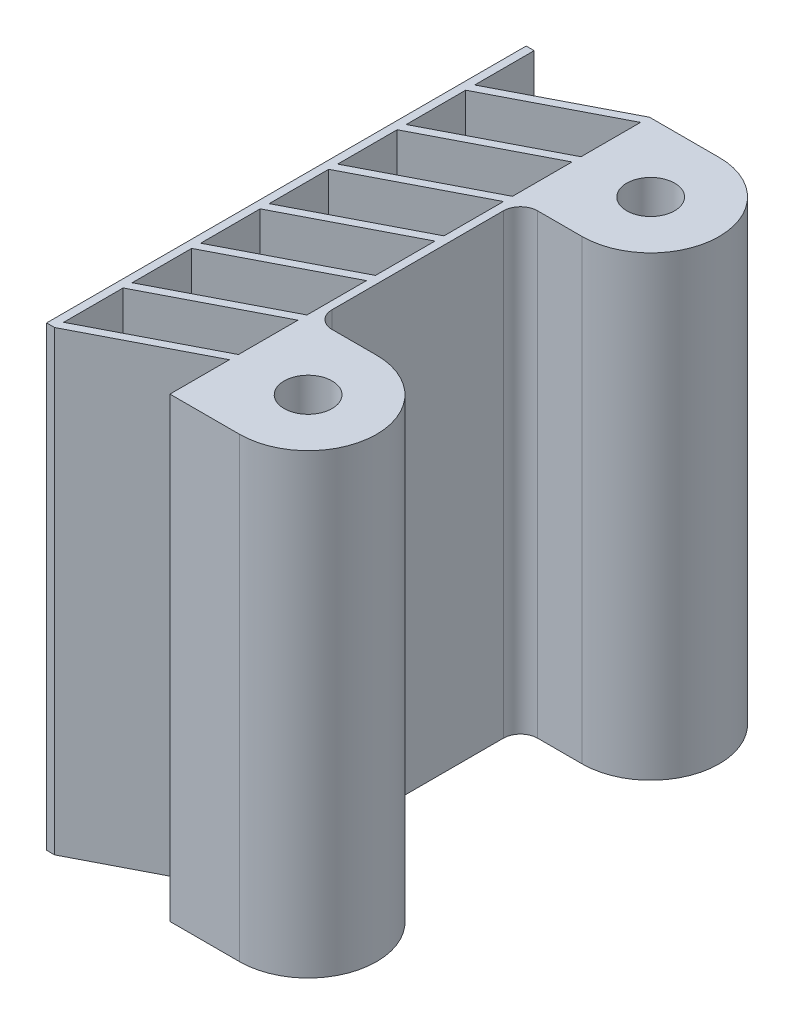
ISO-10303-21;
HEADER;
FILE_DESCRIPTION(('STEP AP214'),'2;1');
FILE_NAME('part.step','',(''),(''),'','','');
FILE_SCHEMA(('AUTOMOTIVE_DESIGN { 1 0 10303 214 1 1 1 1 }'));
ENDSEC;
DATA;
#1=APPLICATION_CONTEXT('core data for automotive mechanical design processes');
#2=APPLICATION_PROTOCOL_DEFINITION('international standard','automotive_design',2000,#1);
#3=PRODUCT_CONTEXT('',#1,'mechanical');
#4=PRODUCT('Part','Part','',(#3));
#5=PRODUCT_RELATED_PRODUCT_CATEGORY('part','',(#4));
#6=PRODUCT_DEFINITION_FORMATION('','',#4);
#7=PRODUCT_DEFINITION_CONTEXT('part definition',#1,'design');
#8=PRODUCT_DEFINITION('design','',#6,#7);
#9=PRODUCT_DEFINITION_SHAPE('','',#8);
#10=(LENGTH_UNIT() NAMED_UNIT(*) SI_UNIT(.MILLI.,.METRE.));
#11=(NAMED_UNIT(*) PLANE_ANGLE_UNIT() SI_UNIT($,.RADIAN.));
#12=(NAMED_UNIT(*) SI_UNIT($,.STERADIAN.) SOLID_ANGLE_UNIT());
#13=UNCERTAINTY_MEASURE_WITH_UNIT(LENGTH_MEASURE(1.E-05),#10,'distance_accuracy_value','');
#14=(GEOMETRIC_REPRESENTATION_CONTEXT(3) GLOBAL_UNCERTAINTY_ASSIGNED_CONTEXT((#13)) GLOBAL_UNIT_ASSIGNED_CONTEXT((#10,
#11,#12)) REPRESENTATION_CONTEXT('',''));
#15=CARTESIAN_POINT('',(0.,0.,0.));
#16=DIRECTION('',(0.,0.,1.));
#17=DIRECTION('',(1.,0.,0.));
#18=AXIS2_PLACEMENT_3D('',#15,#16,#17);
#19=CARTESIAN_POINT('',(-237.,40.,199.));
#20=DIRECTION('',(0.,0.,1.));
#21=DIRECTION('',(1.,0.,0.));
#22=AXIS2_PLACEMENT_3D('',#19,#20,#21);
#23=PLANE('',#22);
#24=DIRECTION('',(-1.,0.,0.));
#25=VECTOR('',#24,1.);
#26=CARTESIAN_POINT('',(-237.,40.,199.));
#27=LINE('',#26,#25);
#28=CARTESIAN_POINT('',(-253.2,40.,199.));
#29=VERTEX_POINT('',#28);
#30=CARTESIAN_POINT('',(-253.9,40.,199.));
#31=VERTEX_POINT('',#30);
#32=EDGE_CURVE('E412',#29,#31,#27,.T.);
#33=ORIENTED_EDGE('',*,*,#32,.F.);
#34=DIRECTION('',(0.,1.,0.));
#35=VECTOR('',#34,1.);
#36=CARTESIAN_POINT('',(-253.2,0.,199.));
#37=LINE('',#36,#35);
#38=CARTESIAN_POINT('',(-253.2,0.,199.));
#39=VERTEX_POINT('',#38);
#40=EDGE_CURVE('E634',#39,#29,#37,.T.);
#41=ORIENTED_EDGE('',*,*,#40,.F.);
#42=DIRECTION('',(-1.,0.,0.));
#43=VECTOR('',#42,1.);
#44=CARTESIAN_POINT('',(-237.,0.,199.));
#45=LINE('',#44,#43);
#46=CARTESIAN_POINT('',(-253.9,0.,199.));
#47=VERTEX_POINT('',#46);
#48=EDGE_CURVE('E347',#39,#47,#45,.T.);
#49=ORIENTED_EDGE('',*,*,#48,.T.);
#50=DIRECTION('',(0.,-1.,0.));
#51=VECTOR('',#50,1.);
#52=CARTESIAN_POINT('',(-253.9,40.,199.));
#53=LINE('',#52,#51);
#54=EDGE_CURVE('E357',#31,#47,#53,.T.);
#55=ORIENTED_EDGE('',*,*,#54,.F.);
#56=EDGE_LOOP('',(#33,#41,#49,#55));
#57=FACE_BOUND('',#56,.T.);
#58=ADVANCED_FACE('F41',(#57),#23,.F.);
#59=CARTESIAN_POINT('',(-253.9,40.,241.));
#60=DIRECTION('',(0.,0.,-1.));
#61=DIRECTION('',(-1.,0.,0.));
#62=AXIS2_PLACEMENT_3D('',#59,#60,#61);
#63=PLANE('',#62);
#64=DIRECTION('',(1.,0.,0.));
#65=VECTOR('',#64,1.);
#66=CARTESIAN_POINT('',(-253.9,0.,241.));
#67=LINE('',#66,#65);
#68=CARTESIAN_POINT('',(-253.9,0.,241.));
#69=VERTEX_POINT('',#68);
#70=CARTESIAN_POINT('',(-253.199999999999,0.,241.));
#71=VERTEX_POINT('',#70);
#72=EDGE_CURVE('E317',#69,#71,#67,.T.);
#73=ORIENTED_EDGE('',*,*,#72,.T.);
#74=DIRECTION('',(0.,1.,0.));
#75=VECTOR('',#74,1.);
#76=CARTESIAN_POINT('',(-253.199999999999,0.,241.));
#77=LINE('',#76,#75);
#78=CARTESIAN_POINT('',(-253.199999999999,40.,241.));
#79=VERTEX_POINT('',#78);
#80=EDGE_CURVE('E300',#71,#79,#77,.T.);
#81=ORIENTED_EDGE('',*,*,#80,.T.);
#82=DIRECTION('',(1.,0.,0.));
#83=VECTOR('',#82,1.);
#84=CARTESIAN_POINT('',(-253.9,40.,241.));
#85=LINE('',#84,#83);
#86=CARTESIAN_POINT('',(-253.9,40.,241.));
#87=VERTEX_POINT('',#86);
#88=EDGE_CURVE('E315',#87,#79,#85,.T.);
#89=ORIENTED_EDGE('',*,*,#88,.F.);
#90=DIRECTION('',(0.,-1.,0.));
#91=VECTOR('',#90,1.);
#92=CARTESIAN_POINT('',(-253.9,40.,241.));
#93=LINE('',#92,#91);
#94=EDGE_CURVE('E328',#87,#69,#93,.T.);
#95=ORIENTED_EDGE('',*,*,#94,.T.);
#96=EDGE_LOOP('',(#73,#81,#89,#95));
#97=FACE_BOUND('',#96,.T.);
#98=ADVANCED_FACE('F313',(#97),#63,.F.);
#99=CARTESIAN_POINT('',(-237.,40.,235.));
#100=DIRECTION('',(0.,1.,0.));
#101=DIRECTION('',(0.,0.,1.));
#102=AXIS2_PLACEMENT_3D('',#99,#100,#101);
#103=PLANE('',#102);
#104=DIRECTION('',(0.,0.,1.));
#105=VECTOR('',#104,1.);
#106=CARTESIAN_POINT('',(-253.199999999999,40.,240.212282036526));
#107=LINE('',#106,#105);
#108=CARTESIAN_POINT('',(-253.2,40.,235.));
#109=VERTEX_POINT('',#108);
#110=CARTESIAN_POINT('',(-253.199999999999,40.,240.212282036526));
#111=VERTEX_POINT('',#110);
#112=EDGE_CURVE('E56',#109,#111,#107,.T.);
#113=ORIENTED_EDGE('',*,*,#112,.F.);
#114=DIRECTION('',(-0.888642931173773,0.,0.458599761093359));
#115=VECTOR('',#114,1.);
#116=CARTESIAN_POINT('',(-253.2,40.,235.));
#117=LINE('',#116,#115);
#118=CARTESIAN_POINT('',(-243.1,40.,229.787717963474));
#119=VERTEX_POINT('',#118);
#120=EDGE_CURVE('E445',#119,#109,#117,.T.);
#121=ORIENTED_EDGE('',*,*,#120,.F.);
#122=DIRECTION('',(0.,0.,-1.));
#123=VECTOR('',#122,1.);
#124=CARTESIAN_POINT('',(-243.1,40.,229.787717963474));
#125=LINE('',#124,#123);
#126=CARTESIAN_POINT('',(-243.1,40.,235.));
#127=VERTEX_POINT('',#126);
#128=EDGE_CURVE('E448',#127,#119,#125,.T.);
#129=ORIENTED_EDGE('',*,*,#128,.F.);
#130=DIRECTION('',(0.888642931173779,0.,-0.458599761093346));
#131=VECTOR('',#130,1.);
#132=CARTESIAN_POINT('',(-243.1,40.,235.));
#133=LINE('',#132,#131);
#134=EDGE_CURVE('E452',#111,#127,#133,.T.);
#135=ORIENTED_EDGE('',*,*,#134,.F.);
#136=EDGE_LOOP('',(#113,#121,#129,#135));
#137=FACE_BOUND('',#136,.T.);
#138=DIRECTION('',(0.,0.,1.));
#139=VECTOR('',#138,1.);
#140=CARTESIAN_POINT('',(-253.2,40.,234.212282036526));
#141=LINE('',#140,#139);
#142=CARTESIAN_POINT('',(-253.2,40.,229.));
#143=VERTEX_POINT('',#142);
#144=CARTESIAN_POINT('',(-253.2,40.,234.212282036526));
#145=VERTEX_POINT('',#144);
#146=EDGE_CURVE('E64',#143,#145,#141,.T.);
#147=ORIENTED_EDGE('',*,*,#146,.F.);
#148=DIRECTION('',(-0.888642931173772,0.,0.45859976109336));
#149=VECTOR('',#148,1.);
#150=CARTESIAN_POINT('',(-253.2,40.,229.));
#151=LINE('',#150,#149);
#152=CARTESIAN_POINT('',(-243.1,40.,223.787717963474));
#153=VERTEX_POINT('',#152);
#154=EDGE_CURVE('E475',#153,#143,#151,.T.);
#155=ORIENTED_EDGE('',*,*,#154,.F.);
#156=DIRECTION('',(0.,0.,-1.));
#157=VECTOR('',#156,1.);
#158=CARTESIAN_POINT('',(-243.1,40.,223.787717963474));
#159=LINE('',#158,#157);
#160=CARTESIAN_POINT('',(-243.1,40.,229.));
#161=VERTEX_POINT('',#160);
#162=EDGE_CURVE('E478',#161,#153,#159,.T.);
#163=ORIENTED_EDGE('',*,*,#162,.F.);
#164=DIRECTION('',(0.888642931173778,0.,-0.458599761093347));
#165=VECTOR('',#164,1.);
#166=CARTESIAN_POINT('',(-243.1,40.,229.));
#167=LINE('',#166,#165);
#168=EDGE_CURVE('E482',#145,#161,#167,.T.);
#169=ORIENTED_EDGE('',*,*,#168,.F.);
#170=EDGE_LOOP('',(#147,#155,#163,#169));
#171=FACE_BOUND('',#170,.T.);
#172=DIRECTION('',(-0.888642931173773,0.,0.458599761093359));
#173=VECTOR('',#172,1.);
#174=CARTESIAN_POINT('',(-253.199999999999,40.,241.));
#175=LINE('',#174,#173);
#176=CARTESIAN_POINT('',(-243.1,40.,235.787717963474));
#177=VERTEX_POINT('',#176);
#178=EDGE_CURVE('E296',#177,#79,#175,.T.);
#179=ORIENTED_EDGE('',*,*,#178,.F.);
#180=DIRECTION('',(0.,0.,-1.));
#181=VECTOR('',#180,1.);
#182=CARTESIAN_POINT('',(-243.1,40.,235.787717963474));
#183=LINE('',#182,#181);
#184=CARTESIAN_POINT('',(-243.1,40.,241.));
#185=VERTEX_POINT('',#184);
#186=EDGE_CURVE('E307',#185,#177,#183,.T.);
#187=ORIENTED_EDGE('',*,*,#186,.F.);
#188=CARTESIAN_POINT('',(-237.,40.,241.));
#189=VERTEX_POINT('',#188);
#190=EDGE_CURVE('E325',#185,#189,#85,.T.);
#191=ORIENTED_EDGE('',*,*,#190,.T.);
#192=CARTESIAN_POINT('',(-237.,40.,235.));
#193=DIRECTION('',(0.,1.,0.));
#194=DIRECTION('',(0.,0.,1.));
#195=AXIS2_PLACEMENT_3D('',#192,#193,#194);
#196=CIRCLE('',#195,6.00000000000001);
#197=CARTESIAN_POINT('',(-237.,40.,229.));
#198=VERTEX_POINT('',#197);
#199=EDGE_CURVE('E354',#189,#198,#196,.T.);
#200=ORIENTED_EDGE('',*,*,#199,.T.);
#201=DIRECTION('',(-1.,0.,0.));
#202=VECTOR('',#201,1.);
#203=CARTESIAN_POINT('',(-237.,40.,229.));
#204=LINE('',#203,#202);
#205=CARTESIAN_POINT('',(-240.9,40.,229.));
#206=VERTEX_POINT('',#205);
#207=EDGE_CURVE('E401',#198,#206,#204,.T.);
#208=ORIENTED_EDGE('',*,*,#207,.T.);
#209=CARTESIAN_POINT('',(-240.9,40.,227.5));
#210=DIRECTION('',(0.,1.,0.));
#211=DIRECTION('',(0.,0.,1.));
#212=AXIS2_PLACEMENT_3D('',#209,#210,#211);
#213=CIRCLE('',#212,1.5);
#214=CARTESIAN_POINT('',(-242.4,40.,227.5));
#215=VERTEX_POINT('',#214);
#216=EDGE_CURVE('E11',#206,#215,#213,.F.);
#217=ORIENTED_EDGE('',*,*,#216,.T.);
#218=DIRECTION('',(0.,0.,-1.));
#219=VECTOR('',#218,1.);
#220=CARTESIAN_POINT('',(-242.4,40.,229.));
#221=LINE('',#220,#219);
#222=CARTESIAN_POINT('',(-242.4,40.,212.5));
#223=VERTEX_POINT('',#222);
#224=EDGE_CURVE('E398',#215,#223,#221,.T.);
#225=ORIENTED_EDGE('',*,*,#224,.T.);
#226=CARTESIAN_POINT('',(-240.9,40.,212.5));
#227=DIRECTION('',(0.,1.,0.));
#228=DIRECTION('',(0.,0.,1.));
#229=AXIS2_PLACEMENT_3D('',#226,#227,#228);
#230=CIRCLE('',#229,1.5);
#231=CARTESIAN_POINT('',(-240.9,40.,211.));
#232=VERTEX_POINT('',#231);
#233=EDGE_CURVE('E381',#223,#232,#230,.F.);
#234=ORIENTED_EDGE('',*,*,#233,.T.);
#235=DIRECTION('',(1.,0.,0.));
#236=VECTOR('',#235,1.);
#237=CARTESIAN_POINT('',(-242.4,40.,211.));
#238=LINE('',#237,#236);
#239=CARTESIAN_POINT('',(-237.,40.,211.));
#240=VERTEX_POINT('',#239);
#241=EDGE_CURVE('E405',#232,#240,#238,.T.);
#242=ORIENTED_EDGE('',*,*,#241,.T.);
#243=CARTESIAN_POINT('',(-237.,40.,205.));
#244=DIRECTION('',(0.,1.,0.));
#245=DIRECTION('',(0.,0.,1.));
#246=AXIS2_PLACEMENT_3D('',#243,#244,#245);
#247=CIRCLE('',#246,6.00000000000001);
#248=CARTESIAN_POINT('',(-237.,40.,199.));
#249=VERTEX_POINT('',#248);
#250=EDGE_CURVE('E407',#240,#249,#247,.T.);
#251=ORIENTED_EDGE('',*,*,#250,.T.);
#252=CARTESIAN_POINT('',(-243.1,40.,199.));
#253=VERTEX_POINT('',#252);
#254=EDGE_CURVE('E413',#249,#253,#27,.T.);
#255=ORIENTED_EDGE('',*,*,#254,.T.);
#256=DIRECTION('',(0.888642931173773,0.,-0.458599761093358));
#257=VECTOR('',#256,1.);
#258=CARTESIAN_POINT('',(-243.1,40.,199.));
#259=LINE('',#258,#257);
#260=CARTESIAN_POINT('',(-253.2,40.,204.212282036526));
#261=VERTEX_POINT('',#260);
#262=EDGE_CURVE('E628',#261,#253,#259,.T.);
#263=ORIENTED_EDGE('',*,*,#262,.F.);
#264=DIRECTION('',(0.,0.,1.));
#265=VECTOR('',#264,1.);
#266=CARTESIAN_POINT('',(-253.2,40.,204.212282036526));
#267=LINE('',#266,#265);
#268=EDGE_CURVE('E421',#29,#261,#267,.T.);
#269=ORIENTED_EDGE('',*,*,#268,.F.);
#270=ORIENTED_EDGE('',*,*,#32,.T.);
#271=DIRECTION('',(0.,0.,1.));
#272=VECTOR('',#271,1.);
#273=CARTESIAN_POINT('',(-253.9,40.,199.));
#274=LINE('',#273,#272);
#275=EDGE_CURVE('E322',#31,#87,#274,.T.);
#276=ORIENTED_EDGE('',*,*,#275,.T.);
#277=ORIENTED_EDGE('',*,*,#88,.T.);
#278=EDGE_LOOP('',(#179,#187,#191,#200,#208,#217,#225,#234,#242,#251,#255,#263,#269,#270,#276,#277));
#279=FACE_BOUND('',#278,.T.);
#280=DIRECTION('',(0.,0.,1.));
#281=VECTOR('',#280,1.);
#282=CARTESIAN_POINT('',(-253.2,40.,216.212282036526));
#283=LINE('',#282,#281);
#284=CARTESIAN_POINT('',(-253.2,40.,211.));
#285=VERTEX_POINT('',#284);
#286=CARTESIAN_POINT('',(-253.2,40.,216.212282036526));
#287=VERTEX_POINT('',#286);
#288=EDGE_CURVE('E580',#285,#287,#283,.T.);
#289=ORIENTED_EDGE('',*,*,#288,.F.);
#290=DIRECTION('',(-0.888642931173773,0.,0.458599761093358));
#291=VECTOR('',#290,1.);
#292=CARTESIAN_POINT('',(-253.2,40.,211.));
#293=LINE('',#292,#291);
#294=CARTESIAN_POINT('',(-243.1,40.,205.787717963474));
#295=VERTEX_POINT('',#294);
#296=EDGE_CURVE('E570',#295,#285,#293,.T.);
#297=ORIENTED_EDGE('',*,*,#296,.F.);
#298=DIRECTION('',(0.,0.,-1.));
#299=VECTOR('',#298,1.);
#300=CARTESIAN_POINT('',(-243.1,40.,205.787717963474));
#301=LINE('',#300,#299);
#302=CARTESIAN_POINT('',(-243.1,40.,211.));
#303=VERTEX_POINT('',#302);
#304=EDGE_CURVE('E573',#303,#295,#301,.T.);
#305=ORIENTED_EDGE('',*,*,#304,.F.);
#306=DIRECTION('',(0.88864293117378,0.,-0.458599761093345));
#307=VECTOR('',#306,1.);
#308=CARTESIAN_POINT('',(-243.1,40.,211.));
#309=LINE('',#308,#307);
#310=EDGE_CURVE('E577',#287,#303,#309,.T.);
#311=ORIENTED_EDGE('',*,*,#310,.F.);
#312=EDGE_LOOP('',(#289,#297,#305,#311));
#313=FACE_BOUND('',#312,.T.);
#314=DIRECTION('',(0.,0.,1.));
#315=VECTOR('',#314,1.);
#316=CARTESIAN_POINT('',(-253.2,40.,210.212282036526));
#317=LINE('',#316,#315);
#318=CARTESIAN_POINT('',(-253.2,40.,205.));
#319=VERTEX_POINT('',#318);
#320=CARTESIAN_POINT('',(-253.2,40.,210.212282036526));
#321=VERTEX_POINT('',#320);
#322=EDGE_CURVE('E612',#319,#321,#317,.T.);
#323=ORIENTED_EDGE('',*,*,#322,.F.);
#324=DIRECTION('',(-0.888642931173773,0.,0.458599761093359));
#325=VECTOR('',#324,1.);
#326=CARTESIAN_POINT('',(-253.2,40.,205.));
#327=LINE('',#326,#325);
#328=CARTESIAN_POINT('',(-243.1,40.,199.787717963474));
#329=VERTEX_POINT('',#328);
#330=EDGE_CURVE('E602',#329,#319,#327,.T.);
#331=ORIENTED_EDGE('',*,*,#330,.F.);
#332=DIRECTION('',(0.,0.,-1.));
#333=VECTOR('',#332,1.);
#334=CARTESIAN_POINT('',(-243.1,40.,199.787717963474));
#335=LINE('',#334,#333);
#336=CARTESIAN_POINT('',(-243.1,40.,205.));
#337=VERTEX_POINT('',#336);
#338=EDGE_CURVE('E605',#337,#329,#335,.T.);
#339=ORIENTED_EDGE('',*,*,#338,.F.);
#340=DIRECTION('',(0.888642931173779,0.,-0.458599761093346));
#341=VECTOR('',#340,1.);
#342=CARTESIAN_POINT('',(-243.1,40.,205.));
#343=LINE('',#342,#341);
#344=EDGE_CURVE('E609',#321,#337,#343,.T.);
#345=ORIENTED_EDGE('',*,*,#344,.F.);
#346=EDGE_LOOP('',(#323,#331,#339,#345));
#347=FACE_BOUND('',#346,.T.);
#348=DIRECTION('',(0.,0.,1.));
#349=VECTOR('',#348,1.);
#350=CARTESIAN_POINT('',(-253.2,40.,228.212282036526));
#351=LINE('',#350,#349);
#352=CARTESIAN_POINT('',(-253.2,40.,223.));
#353=VERTEX_POINT('',#352);
#354=CARTESIAN_POINT('',(-253.2,40.,228.212282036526));
#355=VERTEX_POINT('',#354);
#356=EDGE_CURVE('E516',#353,#355,#351,.T.);
#357=ORIENTED_EDGE('',*,*,#356,.F.);
#358=DIRECTION('',(-0.888642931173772,0.,0.45859976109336));
#359=VECTOR('',#358,1.);
#360=CARTESIAN_POINT('',(-253.2,40.,223.));
#361=LINE('',#360,#359);
#362=CARTESIAN_POINT('',(-243.1,40.,217.787717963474));
#363=VERTEX_POINT('',#362);
#364=EDGE_CURVE('E506',#363,#353,#361,.T.);
#365=ORIENTED_EDGE('',*,*,#364,.F.);
#366=DIRECTION('',(0.,0.,-1.));
#367=VECTOR('',#366,1.);
#368=CARTESIAN_POINT('',(-243.1,40.,217.787717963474));
#369=LINE('',#368,#367);
#370=CARTESIAN_POINT('',(-243.1,40.,223.));
#371=VERTEX_POINT('',#370);
#372=EDGE_CURVE('E509',#371,#363,#369,.T.);
#373=ORIENTED_EDGE('',*,*,#372,.F.);
#374=DIRECTION('',(0.888642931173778,0.,-0.458599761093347));
#375=VECTOR('',#374,1.);
#376=CARTESIAN_POINT('',(-243.1,40.,223.));
#377=LINE('',#376,#375);
#378=EDGE_CURVE('E513',#355,#371,#377,.T.);
#379=ORIENTED_EDGE('',*,*,#378,.F.);
#380=EDGE_LOOP('',(#357,#365,#373,#379));
#381=FACE_BOUND('',#380,.T.);
#382=DIRECTION('',(0.,0.,1.));
#383=VECTOR('',#382,1.);
#384=CARTESIAN_POINT('',(-253.2,40.,222.212282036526));
#385=LINE('',#384,#383);
#386=CARTESIAN_POINT('',(-253.2,40.,217.));
#387=VERTEX_POINT('',#386);
#388=CARTESIAN_POINT('',(-253.2,40.,222.212282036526));
#389=VERTEX_POINT('',#388);
#390=EDGE_CURVE('E548',#387,#389,#385,.T.);
#391=ORIENTED_EDGE('',*,*,#390,.F.);
#392=DIRECTION('',(-0.888642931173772,0.,0.45859976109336));
#393=VECTOR('',#392,1.);
#394=CARTESIAN_POINT('',(-253.2,40.,217.));
#395=LINE('',#394,#393);
#396=CARTESIAN_POINT('',(-243.1,40.,211.787717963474));
#397=VERTEX_POINT('',#396);
#398=EDGE_CURVE('E538',#397,#387,#395,.T.);
#399=ORIENTED_EDGE('',*,*,#398,.F.);
#400=DIRECTION('',(0.,0.,-1.));
#401=VECTOR('',#400,1.);
#402=CARTESIAN_POINT('',(-243.1,40.,211.787717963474));
#403=LINE('',#402,#401);
#404=CARTESIAN_POINT('',(-243.1,40.,217.));
#405=VERTEX_POINT('',#404);
#406=EDGE_CURVE('E541',#405,#397,#403,.T.);
#407=ORIENTED_EDGE('',*,*,#406,.F.);
#408=DIRECTION('',(0.88864293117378,0.,-0.458599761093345));
#409=VECTOR('',#408,1.);
#410=CARTESIAN_POINT('',(-243.1,40.,217.));
#411=LINE('',#410,#409);
#412=EDGE_CURVE('E545',#389,#405,#411,.T.);
#413=ORIENTED_EDGE('',*,*,#412,.F.);
#414=EDGE_LOOP('',(#391,#399,#407,#413));
#415=FACE_BOUND('',#414,.T.);
#416=CARTESIAN_POINT('',(-237.,40.,235.));
#417=DIRECTION('',(0.,1.,0.));
#418=DIRECTION('',(0.,0.,1.));
#419=AXIS2_PLACEMENT_3D('',#416,#417,#418);
#420=CIRCLE('',#419,2.09999999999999);
#421=CARTESIAN_POINT('',(-237.,40.,237.1));
#422=VERTEX_POINT('',#421);
#423=EDGE_CURVE('E337',#422,#422,#420,.T.);
#424=ORIENTED_EDGE('',*,*,#423,.F.);
#425=EDGE_LOOP('',(#424));
#426=FACE_BOUND('',#425,.T.);
#427=CARTESIAN_POINT('',(-237.,40.,205.));
#428=DIRECTION('',(0.,1.,0.));
#429=DIRECTION('',(0.,0.,1.));
#430=AXIS2_PLACEMENT_3D('',#427,#428,#429);
#431=CIRCLE('',#430,2.09999999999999);
#432=CARTESIAN_POINT('',(-237.,40.,207.1));
#433=VERTEX_POINT('',#432);
#434=EDGE_CURVE('E641',#433,#433,#431,.T.);
#435=ORIENTED_EDGE('',*,*,#434,.F.);
#436=EDGE_LOOP('',(#435));
#437=FACE_BOUND('',#436,.T.);
#438=ADVANCED_FACE('F319',(#137,#171,#279,#313,#347,#381,#415,#426,#437),#103,.T.);
#439=CARTESIAN_POINT('',(-237.,0.,235.));
#440=DIRECTION('',(0.,1.,0.));
#441=DIRECTION('',(0.,0.,1.));
#442=AXIS2_PLACEMENT_3D('',#439,#440,#441);
#443=PLANE('',#442);
#444=DIRECTION('',(-0.888642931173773,0.,0.458599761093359));
#445=VECTOR('',#444,1.);
#446=CARTESIAN_POINT('',(-253.2,0.,235.));
#447=LINE('',#446,#445);
#448=CARTESIAN_POINT('',(-243.1,0.,229.787717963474));
#449=VERTEX_POINT('',#448);
#450=CARTESIAN_POINT('',(-253.2,0.,235.));
#451=VERTEX_POINT('',#450);
#452=EDGE_CURVE('E438',#449,#451,#447,.T.);
#453=ORIENTED_EDGE('',*,*,#452,.T.);
#454=DIRECTION('',(0.,0.,1.));
#455=VECTOR('',#454,1.);
#456=CARTESIAN_POINT('',(-253.199999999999,0.,240.212282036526));
#457=LINE('',#456,#455);
#458=CARTESIAN_POINT('',(-253.199999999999,0.,240.212282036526));
#459=VERTEX_POINT('',#458);
#460=EDGE_CURVE('E449',#451,#459,#457,.T.);
#461=ORIENTED_EDGE('',*,*,#460,.T.);
#462=DIRECTION('',(0.888642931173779,0.,-0.458599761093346));
#463=VECTOR('',#462,1.);
#464=CARTESIAN_POINT('',(-243.1,0.,235.));
#465=LINE('',#464,#463);
#466=CARTESIAN_POINT('',(-243.1,0.,235.));
#467=VERTEX_POINT('',#466);
#468=EDGE_CURVE('E462',#459,#467,#465,.T.);
#469=ORIENTED_EDGE('',*,*,#468,.T.);
#470=DIRECTION('',(0.,0.,-1.));
#471=VECTOR('',#470,1.);
#472=CARTESIAN_POINT('',(-243.1,0.,229.787717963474));
#473=LINE('',#472,#471);
#474=EDGE_CURVE('E459',#467,#449,#473,.T.);
#475=ORIENTED_EDGE('',*,*,#474,.T.);
#476=EDGE_LOOP('',(#453,#461,#469,#475));
#477=FACE_BOUND('',#476,.T.);
#478=DIRECTION('',(-0.888642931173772,0.,0.45859976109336));
#479=VECTOR('',#478,1.);
#480=CARTESIAN_POINT('',(-253.2,0.,229.));
#481=LINE('',#480,#479);
#482=CARTESIAN_POINT('',(-243.1,0.,223.787717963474));
#483=VERTEX_POINT('',#482);
#484=CARTESIAN_POINT('',(-253.2,0.,229.));
#485=VERTEX_POINT('',#484);
#486=EDGE_CURVE('E469',#483,#485,#481,.T.);
#487=ORIENTED_EDGE('',*,*,#486,.T.);
#488=DIRECTION('',(0.,0.,1.));
#489=VECTOR('',#488,1.);
#490=CARTESIAN_POINT('',(-253.2,0.,234.212282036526));
#491=LINE('',#490,#489);
#492=CARTESIAN_POINT('',(-253.2,0.,234.212282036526));
#493=VERTEX_POINT('',#492);
#494=EDGE_CURVE('E479',#485,#493,#491,.T.);
#495=ORIENTED_EDGE('',*,*,#494,.T.);
#496=DIRECTION('',(0.888642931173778,0.,-0.458599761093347));
#497=VECTOR('',#496,1.);
#498=CARTESIAN_POINT('',(-243.1,0.,229.));
#499=LINE('',#498,#497);
#500=CARTESIAN_POINT('',(-243.1,0.,229.));
#501=VERTEX_POINT('',#500);
#502=EDGE_CURVE('E492',#493,#501,#499,.T.);
#503=ORIENTED_EDGE('',*,*,#502,.T.);
#504=DIRECTION('',(0.,0.,-1.));
#505=VECTOR('',#504,1.);
#506=CARTESIAN_POINT('',(-243.1,0.,223.787717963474));
#507=LINE('',#506,#505);
#508=EDGE_CURVE('E489',#501,#483,#507,.T.);
#509=ORIENTED_EDGE('',*,*,#508,.T.);
#510=EDGE_LOOP('',(#487,#495,#503,#509));
#511=FACE_BOUND('',#510,.T.);
#512=DIRECTION('',(-0.888642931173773,0.,0.458599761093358));
#513=VECTOR('',#512,1.);
#514=CARTESIAN_POINT('',(-253.2,0.,211.));
#515=LINE('',#514,#513);
#516=CARTESIAN_POINT('',(-243.1,0.,205.787717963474));
#517=VERTEX_POINT('',#516);
#518=CARTESIAN_POINT('',(-253.2,0.,211.));
#519=VERTEX_POINT('',#518);
#520=EDGE_CURVE('E564',#517,#519,#515,.T.);
#521=ORIENTED_EDGE('',*,*,#520,.T.);
#522=DIRECTION('',(0.,0.,1.));
#523=VECTOR('',#522,1.);
#524=CARTESIAN_POINT('',(-253.2,0.,216.212282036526));
#525=LINE('',#524,#523);
#526=CARTESIAN_POINT('',(-253.2,0.,216.212282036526));
#527=VERTEX_POINT('',#526);
#528=EDGE_CURVE('E574',#519,#527,#525,.T.);
#529=ORIENTED_EDGE('',*,*,#528,.T.);
#530=DIRECTION('',(0.88864293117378,0.,-0.458599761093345));
#531=VECTOR('',#530,1.);
#532=CARTESIAN_POINT('',(-243.1,0.,211.));
#533=LINE('',#532,#531);
#534=CARTESIAN_POINT('',(-243.1,0.,211.));
#535=VERTEX_POINT('',#534);
#536=EDGE_CURVE('E588',#527,#535,#533,.T.);
#537=ORIENTED_EDGE('',*,*,#536,.T.);
#538=DIRECTION('',(0.,0.,-1.));
#539=VECTOR('',#538,1.);
#540=CARTESIAN_POINT('',(-243.1,0.,205.787717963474));
#541=LINE('',#540,#539);
#542=EDGE_CURVE('E585',#535,#517,#541,.T.);
#543=ORIENTED_EDGE('',*,*,#542,.T.);
#544=EDGE_LOOP('',(#521,#529,#537,#543));
#545=FACE_BOUND('',#544,.T.);
#546=DIRECTION('',(-0.888642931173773,0.,0.458599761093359));
#547=VECTOR('',#546,1.);
#548=CARTESIAN_POINT('',(-253.2,0.,205.));
#549=LINE('',#548,#547);
#550=CARTESIAN_POINT('',(-243.1,0.,199.787717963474));
#551=VERTEX_POINT('',#550);
#552=CARTESIAN_POINT('',(-253.2,0.,205.));
#553=VERTEX_POINT('',#552);
#554=EDGE_CURVE('E596',#551,#553,#549,.T.);
#555=ORIENTED_EDGE('',*,*,#554,.T.);
#556=DIRECTION('',(0.,0.,1.));
#557=VECTOR('',#556,1.);
#558=CARTESIAN_POINT('',(-253.2,0.,210.212282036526));
#559=LINE('',#558,#557);
#560=CARTESIAN_POINT('',(-253.2,0.,210.212282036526));
#561=VERTEX_POINT('',#560);
#562=EDGE_CURVE('E606',#553,#561,#559,.T.);
#563=ORIENTED_EDGE('',*,*,#562,.T.);
#564=DIRECTION('',(0.888642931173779,0.,-0.458599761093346));
#565=VECTOR('',#564,1.);
#566=CARTESIAN_POINT('',(-243.1,0.,205.));
#567=LINE('',#566,#565);
#568=CARTESIAN_POINT('',(-243.1,0.,205.));
#569=VERTEX_POINT('',#568);
#570=EDGE_CURVE('E619',#561,#569,#567,.T.);
#571=ORIENTED_EDGE('',*,*,#570,.T.);
#572=DIRECTION('',(0.,0.,-1.));
#573=VECTOR('',#572,1.);
#574=CARTESIAN_POINT('',(-243.1,0.,199.787717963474));
#575=LINE('',#574,#573);
#576=EDGE_CURVE('E616',#569,#551,#575,.T.);
#577=ORIENTED_EDGE('',*,*,#576,.T.);
#578=EDGE_LOOP('',(#555,#563,#571,#577));
#579=FACE_BOUND('',#578,.T.);
#580=DIRECTION('',(-0.888642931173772,0.,0.45859976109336));
#581=VECTOR('',#580,1.);
#582=CARTESIAN_POINT('',(-253.2,0.,223.));
#583=LINE('',#582,#581);
#584=CARTESIAN_POINT('',(-243.1,0.,217.787717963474));
#585=VERTEX_POINT('',#584);
#586=CARTESIAN_POINT('',(-253.2,0.,223.));
#587=VERTEX_POINT('',#586);
#588=EDGE_CURVE('E500',#585,#587,#583,.T.);
#589=ORIENTED_EDGE('',*,*,#588,.T.);
#590=DIRECTION('',(0.,0.,1.));
#591=VECTOR('',#590,1.);
#592=CARTESIAN_POINT('',(-253.2,0.,228.212282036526));
#593=LINE('',#592,#591);
#594=CARTESIAN_POINT('',(-253.2,0.,228.212282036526));
#595=VERTEX_POINT('',#594);
#596=EDGE_CURVE('E510',#587,#595,#593,.T.);
#597=ORIENTED_EDGE('',*,*,#596,.T.);
#598=DIRECTION('',(0.888642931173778,0.,-0.458599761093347));
#599=VECTOR('',#598,1.);
#600=CARTESIAN_POINT('',(-243.1,0.,223.));
#601=LINE('',#600,#599);
#602=CARTESIAN_POINT('',(-243.1,0.,223.));
#603=VERTEX_POINT('',#602);
#604=EDGE_CURVE('E524',#595,#603,#601,.T.);
#605=ORIENTED_EDGE('',*,*,#604,.T.);
#606=DIRECTION('',(0.,0.,-1.));
#607=VECTOR('',#606,1.);
#608=CARTESIAN_POINT('',(-243.1,0.,217.787717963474));
#609=LINE('',#608,#607);
#610=EDGE_CURVE('E521',#603,#585,#609,.T.);
#611=ORIENTED_EDGE('',*,*,#610,.T.);
#612=EDGE_LOOP('',(#589,#597,#605,#611));
#613=FACE_BOUND('',#612,.T.);
#614=DIRECTION('',(-0.888642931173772,0.,0.45859976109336));
#615=VECTOR('',#614,1.);
#616=CARTESIAN_POINT('',(-253.2,0.,217.));
#617=LINE('',#616,#615);
#618=CARTESIAN_POINT('',(-243.1,0.,211.787717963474));
#619=VERTEX_POINT('',#618);
#620=CARTESIAN_POINT('',(-253.2,0.,217.));
#621=VERTEX_POINT('',#620);
#622=EDGE_CURVE('E532',#619,#621,#617,.T.);
#623=ORIENTED_EDGE('',*,*,#622,.T.);
#624=DIRECTION('',(0.,0.,1.));
#625=VECTOR('',#624,1.);
#626=CARTESIAN_POINT('',(-253.2,0.,222.212282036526));
#627=LINE('',#626,#625);
#628=CARTESIAN_POINT('',(-253.2,0.,222.212282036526));
#629=VERTEX_POINT('',#628);
#630=EDGE_CURVE('E542',#621,#629,#627,.T.);
#631=ORIENTED_EDGE('',*,*,#630,.T.);
#632=DIRECTION('',(0.88864293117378,0.,-0.458599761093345));
#633=VECTOR('',#632,1.);
#634=CARTESIAN_POINT('',(-243.1,0.,217.));
#635=LINE('',#634,#633);
#636=CARTESIAN_POINT('',(-243.1,0.,217.));
#637=VERTEX_POINT('',#636);
#638=EDGE_CURVE('E556',#629,#637,#635,.T.);
#639=ORIENTED_EDGE('',*,*,#638,.T.);
#640=DIRECTION('',(0.,0.,-1.));
#641=VECTOR('',#640,1.);
#642=CARTESIAN_POINT('',(-243.1,0.,211.787717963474));
#643=LINE('',#642,#641);
#644=EDGE_CURVE('E553',#637,#619,#643,.T.);
#645=ORIENTED_EDGE('',*,*,#644,.T.);
#646=EDGE_LOOP('',(#623,#631,#639,#645));
#647=FACE_BOUND('',#646,.T.);
#648=DIRECTION('',(0.,0.,-1.));
#649=VECTOR('',#648,1.);
#650=CARTESIAN_POINT('',(-243.1,0.,235.787717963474));
#651=LINE('',#650,#649);
#652=CARTESIAN_POINT('',(-243.1,0.,241.));
#653=VERTEX_POINT('',#652);
#654=CARTESIAN_POINT('',(-243.1,0.,235.787717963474));
#655=VERTEX_POINT('',#654);
#656=EDGE_CURVE('E308',#653,#655,#651,.T.);
#657=ORIENTED_EDGE('',*,*,#656,.T.);
#658=DIRECTION('',(-0.888642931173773,0.,0.458599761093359));
#659=VECTOR('',#658,1.);
#660=CARTESIAN_POINT('',(-253.199999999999,0.,241.));
#661=LINE('',#660,#659);
#662=EDGE_CURVE('E428',#655,#71,#661,.T.);
#663=ORIENTED_EDGE('',*,*,#662,.T.);
#664=ORIENTED_EDGE('',*,*,#72,.F.);
#665=DIRECTION('',(0.,0.,1.));
#666=VECTOR('',#665,1.);
#667=CARTESIAN_POINT('',(-253.9,0.,199.));
#668=LINE('',#667,#666);
#669=EDGE_CURVE('E351',#47,#69,#668,.T.);
#670=ORIENTED_EDGE('',*,*,#669,.F.);
#671=ORIENTED_EDGE('',*,*,#48,.F.);
#672=DIRECTION('',(0.,0.,1.));
#673=VECTOR('',#672,1.);
#674=CARTESIAN_POINT('',(-253.2,0.,204.212282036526));
#675=LINE('',#674,#673);
#676=CARTESIAN_POINT('',(-253.2,0.,204.212282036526));
#677=VERTEX_POINT('',#676);
#678=EDGE_CURVE('E624',#39,#677,#675,.T.);
#679=ORIENTED_EDGE('',*,*,#678,.T.);
#680=DIRECTION('',(0.888642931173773,0.,-0.458599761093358));
#681=VECTOR('',#680,1.);
#682=CARTESIAN_POINT('',(-243.1,0.,199.));
#683=LINE('',#682,#681);
#684=CARTESIAN_POINT('',(-243.1,0.,199.));
#685=VERTEX_POINT('',#684);
#686=EDGE_CURVE('E627',#677,#685,#683,.T.);
#687=ORIENTED_EDGE('',*,*,#686,.T.);
#688=CARTESIAN_POINT('',(-237.,0.,199.));
#689=VERTEX_POINT('',#688);
#690=EDGE_CURVE('E348',#689,#685,#45,.T.);
#691=ORIENTED_EDGE('',*,*,#690,.F.);
#692=CARTESIAN_POINT('',(-237.,0.,205.));
#693=DIRECTION('',(0.,1.,0.));
#694=DIRECTION('',(0.,0.,1.));
#695=AXIS2_PLACEMENT_3D('',#692,#693,#694);
#696=CIRCLE('',#695,6.00000000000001);
#697=CARTESIAN_POINT('',(-237.,0.,211.));
#698=VERTEX_POINT('',#697);
#699=EDGE_CURVE('E345',#698,#689,#696,.T.);
#700=ORIENTED_EDGE('',*,*,#699,.F.);
#701=DIRECTION('',(1.,0.,0.));
#702=VECTOR('',#701,1.);
#703=CARTESIAN_POINT('',(-242.4,0.,211.));
#704=LINE('',#703,#702);
#705=CARTESIAN_POINT('',(-240.9,0.,211.));
#706=VERTEX_POINT('',#705);
#707=EDGE_CURVE('E343',#706,#698,#704,.T.);
#708=ORIENTED_EDGE('',*,*,#707,.F.);
#709=CARTESIAN_POINT('',(-240.9,0.,212.5));
#710=DIRECTION('',(0.,1.,0.));
#711=DIRECTION('',(0.,0.,1.));
#712=AXIS2_PLACEMENT_3D('',#709,#710,#711);
#713=CIRCLE('',#712,1.5);
#714=CARTESIAN_POINT('',(-242.4,0.,212.5));
#715=VERTEX_POINT('',#714);
#716=EDGE_CURVE('E379',#706,#715,#713,.T.);
#717=ORIENTED_EDGE('',*,*,#716,.T.);
#718=DIRECTION('',(0.,0.,-1.));
#719=VECTOR('',#718,1.);
#720=CARTESIAN_POINT('',(-242.4,0.,229.));
#721=LINE('',#720,#719);
#722=CARTESIAN_POINT('',(-242.4,0.,227.5));
#723=VERTEX_POINT('',#722);
#724=EDGE_CURVE('E340',#723,#715,#721,.T.);
#725=ORIENTED_EDGE('',*,*,#724,.F.);
#726=CARTESIAN_POINT('',(-240.9,0.,227.5));
#727=DIRECTION('',(0.,1.,0.));
#728=DIRECTION('',(0.,0.,1.));
#729=AXIS2_PLACEMENT_3D('',#726,#727,#728);
#730=CIRCLE('',#729,1.5);
#731=CARTESIAN_POINT('',(-240.9,0.,229.));
#732=VERTEX_POINT('',#731);
#733=EDGE_CURVE('E49',#723,#732,#730,.T.);
#734=ORIENTED_EDGE('',*,*,#733,.T.);
#735=DIRECTION('',(-1.,0.,0.));
#736=VECTOR('',#735,1.);
#737=CARTESIAN_POINT('',(-237.,0.,229.));
#738=LINE('',#737,#736);
#739=CARTESIAN_POINT('',(-237.,0.,229.));
#740=VERTEX_POINT('',#739);
#741=EDGE_CURVE('E336',#740,#732,#738,.T.);
#742=ORIENTED_EDGE('',*,*,#741,.F.);
#743=CARTESIAN_POINT('',(-237.,0.,235.));
#744=DIRECTION('',(0.,1.,0.));
#745=DIRECTION('',(0.,0.,1.));
#746=AXIS2_PLACEMENT_3D('',#743,#744,#745);
#747=CIRCLE('',#746,6.00000000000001);
#748=CARTESIAN_POINT('',(-237.,0.,241.));
#749=VERTEX_POINT('',#748);
#750=EDGE_CURVE('E333',#749,#740,#747,.T.);
#751=ORIENTED_EDGE('',*,*,#750,.F.);
#752=EDGE_CURVE('E353',#653,#749,#67,.T.);
#753=ORIENTED_EDGE('',*,*,#752,.F.);
#754=EDGE_LOOP('',(#657,#663,#664,#670,#671,#679,#687,#691,#700,#708,#717,#725,#734,#742,#751,#753));
#755=FACE_BOUND('',#754,.T.);
#756=CARTESIAN_POINT('',(-237.,0.,235.));
#757=DIRECTION('',(0.,1.,0.));
#758=DIRECTION('',(0.,0.,1.));
#759=AXIS2_PLACEMENT_3D('',#756,#757,#758);
#760=CIRCLE('',#759,2.09999999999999);
#761=CARTESIAN_POINT('',(-237.,0.,237.1));
#762=VERTEX_POINT('',#761);
#763=EDGE_CURVE('E644',#762,#762,#760,.T.);
#764=ORIENTED_EDGE('',*,*,#763,.T.);
#765=EDGE_LOOP('',(#764));
#766=FACE_BOUND('',#765,.T.);
#767=CARTESIAN_POINT('',(-237.,0.,205.));
#768=DIRECTION('',(0.,1.,0.));
#769=DIRECTION('',(0.,0.,1.));
#770=AXIS2_PLACEMENT_3D('',#767,#768,#769);
#771=CIRCLE('',#770,2.09999999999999);
#772=CARTESIAN_POINT('',(-237.,0.,207.1));
#773=VERTEX_POINT('',#772);
#774=EDGE_CURVE('E636',#773,#773,#771,.T.);
#775=ORIENTED_EDGE('',*,*,#774,.T.);
#776=EDGE_LOOP('',(#775));
#777=FACE_BOUND('',#776,.T.);
#778=ADVANCED_FACE('F385',(#477,#511,#545,#579,#613,#647,#755,#766,#777),#443,.F.);
#779=CARTESIAN_POINT('',(-237.,40.,235.));
#780=DIRECTION('',(0.,-1.,0.));
#781=DIRECTION('',(0.,0.,-1.));
#782=AXIS2_PLACEMENT_3D('',#779,#780,#781);
#783=CYLINDRICAL_SURFACE('',#782,6.00000000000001);
#784=ORIENTED_EDGE('',*,*,#750,.T.);
#785=DIRECTION('',(0.,-1.,0.));
#786=VECTOR('',#785,1.);
#787=CARTESIAN_POINT('',(-237.,40.,229.));
#788=LINE('',#787,#786);
#789=EDGE_CURVE('E366',#198,#740,#788,.T.);
#790=ORIENTED_EDGE('',*,*,#789,.F.);
#791=ORIENTED_EDGE('',*,*,#199,.F.);
#792=DIRECTION('',(0.,-1.,0.));
#793=VECTOR('',#792,1.);
#794=CARTESIAN_POINT('',(-237.,40.,241.));
#795=LINE('',#794,#793);
#796=EDGE_CURVE('E324',#189,#749,#795,.T.);
#797=ORIENTED_EDGE('',*,*,#796,.T.);
#798=EDGE_LOOP('',(#784,#790,#791,#797));
#799=FACE_BOUND('',#798,.T.);
#800=ADVANCED_FACE('F654',(#799),#783,.T.);
#801=CARTESIAN_POINT('',(-237.,40.,229.));
#802=DIRECTION('',(0.,0.,1.));
#803=DIRECTION('',(1.,0.,0.));
#804=AXIS2_PLACEMENT_3D('',#801,#802,#803);
#805=PLANE('',#804);
#806=ORIENTED_EDGE('',*,*,#741,.T.);
#807=DIRECTION('',(0.,-1.,0.));
#808=VECTOR('',#807,1.);
#809=CARTESIAN_POINT('',(-240.9,40.,229.));
#810=LINE('',#809,#808);
#811=EDGE_CURVE('E377',#732,#206,#810,.F.);
#812=ORIENTED_EDGE('',*,*,#811,.T.);
#813=ORIENTED_EDGE('',*,*,#207,.F.);
#814=ORIENTED_EDGE('',*,*,#789,.T.);
#815=EDGE_LOOP('',(#806,#812,#813,#814));
#816=FACE_BOUND('',#815,.T.);
#817=ADVANCED_FACE('F392',(#816),#805,.F.);
#818=CARTESIAN_POINT('',(-242.4,40.,229.));
#819=DIRECTION('',(-1.,0.,0.));
#820=DIRECTION('',(0.,0.,1.));
#821=AXIS2_PLACEMENT_3D('',#818,#819,#820);
#822=PLANE('',#821);
#823=ORIENTED_EDGE('',*,*,#724,.T.);
#824=DIRECTION('',(0.,-1.,0.));
#825=VECTOR('',#824,1.);
#826=CARTESIAN_POINT('',(-242.4,40.,212.5));
#827=LINE('',#826,#825);
#828=EDGE_CURVE('E375',#715,#223,#827,.F.);
#829=ORIENTED_EDGE('',*,*,#828,.T.);
#830=ORIENTED_EDGE('',*,*,#224,.F.);
#831=DIRECTION('',(0.,-1.,0.));
#832=VECTOR('',#831,1.);
#833=CARTESIAN_POINT('',(-242.4,0.,227.5));
#834=LINE('',#833,#832);
#835=EDGE_CURVE('E372',#215,#723,#834,.T.);
#836=ORIENTED_EDGE('',*,*,#835,.T.);
#837=EDGE_LOOP('',(#823,#829,#830,#836));
#838=FACE_BOUND('',#837,.T.);
#839=ADVANCED_FACE('F403',(#838),#822,.F.);
#840=CARTESIAN_POINT('',(-242.4,40.,211.));
#841=DIRECTION('',(0.,0.,-1.));
#842=DIRECTION('',(-1.,0.,0.));
#843=AXIS2_PLACEMENT_3D('',#840,#841,#842);
#844=PLANE('',#843);
#845=ORIENTED_EDGE('',*,*,#241,.F.);
#846=DIRECTION('',(0.,-1.,0.));
#847=VECTOR('',#846,1.);
#848=CARTESIAN_POINT('',(-240.9,0.,211.));
#849=LINE('',#848,#847);
#850=EDGE_CURVE('E369',#232,#706,#849,.T.);
#851=ORIENTED_EDGE('',*,*,#850,.T.);
#852=ORIENTED_EDGE('',*,*,#707,.T.);
#853=DIRECTION('',(0.,-1.,0.));
#854=VECTOR('',#853,1.);
#855=CARTESIAN_POINT('',(-237.,40.,211.));
#856=LINE('',#855,#854);
#857=EDGE_CURVE('E363',#240,#698,#856,.T.);
#858=ORIENTED_EDGE('',*,*,#857,.F.);
#859=EDGE_LOOP('',(#845,#851,#852,#858));
#860=FACE_BOUND('',#859,.T.);
#861=ADVANCED_FACE('F691',(#860),#844,.F.);
#862=CARTESIAN_POINT('',(-237.,40.,205.));
#863=DIRECTION('',(0.,-1.,0.));
#864=DIRECTION('',(0.,0.,-1.));
#865=AXIS2_PLACEMENT_3D('',#862,#863,#864);
#866=CYLINDRICAL_SURFACE('',#865,6.00000000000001);
#867=ORIENTED_EDGE('',*,*,#699,.T.);
#868=DIRECTION('',(0.,-1.,0.));
#869=VECTOR('',#868,1.);
#870=CARTESIAN_POINT('',(-237.,40.,199.));
#871=LINE('',#870,#869);
#872=EDGE_CURVE('E360',#249,#689,#871,.T.);
#873=ORIENTED_EDGE('',*,*,#872,.F.);
#874=ORIENTED_EDGE('',*,*,#250,.F.);
#875=ORIENTED_EDGE('',*,*,#857,.T.);
#876=EDGE_LOOP('',(#867,#873,#874,#875));
#877=FACE_BOUND('',#876,.T.);
#878=ADVANCED_FACE('F683',(#877),#866,.T.);
#879=ORIENTED_EDGE('',*,*,#690,.T.);
#880=DIRECTION('',(0.,1.,0.));
#881=VECTOR('',#880,1.);
#882=CARTESIAN_POINT('',(-243.1,0.,199.));
#883=LINE('',#882,#881);
#884=EDGE_CURVE('E637',#685,#253,#883,.T.);
#885=ORIENTED_EDGE('',*,*,#884,.T.);
#886=ORIENTED_EDGE('',*,*,#254,.F.);
#887=ORIENTED_EDGE('',*,*,#872,.T.);
#888=EDGE_LOOP('',(#879,#885,#886,#887));
#889=FACE_BOUND('',#888,.T.);
#890=ADVANCED_FACE('F674',(#889),#23,.F.);
#891=CARTESIAN_POINT('',(-253.9,40.,199.));
#892=DIRECTION('',(1.,0.,0.));
#893=DIRECTION('',(0.,0.,-1.));
#894=AXIS2_PLACEMENT_3D('',#891,#892,#893);
#895=PLANE('',#894);
#896=ORIENTED_EDGE('',*,*,#669,.T.);
#897=ORIENTED_EDGE('',*,*,#94,.F.);
#898=ORIENTED_EDGE('',*,*,#275,.F.);
#899=ORIENTED_EDGE('',*,*,#54,.T.);
#900=EDGE_LOOP('',(#896,#897,#898,#899));
#901=FACE_BOUND('',#900,.T.);
#902=ADVANCED_FACE('F427',(#901),#895,.F.);
#903=ORIENTED_EDGE('',*,*,#190,.F.);
#904=DIRECTION('',(0.,1.,0.));
#905=VECTOR('',#904,1.);
#906=CARTESIAN_POINT('',(-243.1,0.,241.));
#907=LINE('',#906,#905);
#908=EDGE_CURVE('E430',#653,#185,#907,.T.);
#909=ORIENTED_EDGE('',*,*,#908,.F.);
#910=ORIENTED_EDGE('',*,*,#752,.T.);
#911=ORIENTED_EDGE('',*,*,#796,.F.);
#912=EDGE_LOOP('',(#903,#909,#910,#911));
#913=FACE_BOUND('',#912,.T.);
#914=ADVANCED_FACE('F657',(#913),#63,.F.);
#915=CARTESIAN_POINT('',(-237.,40.,235.));
#916=DIRECTION('',(0.,-1.,0.));
#917=DIRECTION('',(0.,0.,-1.));
#918=AXIS2_PLACEMENT_3D('',#915,#916,#917);
#919=CYLINDRICAL_SURFACE('',#918,2.09999999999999);
#920=ORIENTED_EDGE('',*,*,#423,.T.);
#921=EDGE_LOOP('',(#920));
#922=FACE_BOUND('',#921,.T.);
#923=ORIENTED_EDGE('',*,*,#763,.F.);
#924=EDGE_LOOP('',(#923));
#925=FACE_BOUND('',#924,.T.);
#926=ADVANCED_FACE('F716',(#922,#925),#919,.F.);
#927=CARTESIAN_POINT('',(-237.,40.,205.));
#928=DIRECTION('',(0.,-1.,0.));
#929=DIRECTION('',(0.,0.,-1.));
#930=AXIS2_PLACEMENT_3D('',#927,#928,#929);
#931=CYLINDRICAL_SURFACE('',#930,2.09999999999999);
#932=ORIENTED_EDGE('',*,*,#434,.T.);
#933=EDGE_LOOP('',(#932));
#934=FACE_BOUND('',#933,.T.);
#935=ORIENTED_EDGE('',*,*,#774,.F.);
#936=EDGE_LOOP('',(#935));
#937=FACE_BOUND('',#936,.T.);
#938=ADVANCED_FACE('F712',(#934,#937),#931,.F.);
#939=CARTESIAN_POINT('',(-240.9,40.,212.5));
#940=DIRECTION('',(0.,1.,0.));
#941=DIRECTION('',(0.,0.,1.));
#942=AXIS2_PLACEMENT_3D('',#939,#940,#941);
#943=CYLINDRICAL_SURFACE('',#942,1.5);
#944=ORIENTED_EDGE('',*,*,#233,.F.);
#945=ORIENTED_EDGE('',*,*,#828,.F.);
#946=ORIENTED_EDGE('',*,*,#716,.F.);
#947=ORIENTED_EDGE('',*,*,#850,.F.);
#948=EDGE_LOOP('',(#944,#945,#946,#947));
#949=FACE_BOUND('',#948,.T.);
#950=ADVANCED_FACE('F715',(#949),#943,.F.);
#951=CARTESIAN_POINT('',(-240.9,40.,227.5));
#952=DIRECTION('',(0.,1.,0.));
#953=DIRECTION('',(0.,0.,1.));
#954=AXIS2_PLACEMENT_3D('',#951,#952,#953);
#955=CYLINDRICAL_SURFACE('',#954,1.5);
#956=ORIENTED_EDGE('',*,*,#216,.F.);
#957=ORIENTED_EDGE('',*,*,#811,.F.);
#958=ORIENTED_EDGE('',*,*,#733,.F.);
#959=ORIENTED_EDGE('',*,*,#835,.F.);
#960=EDGE_LOOP('',(#956,#957,#958,#959));
#961=FACE_BOUND('',#960,.T.);
#962=ADVANCED_FACE('F43',(#961),#955,.F.);
#963=CARTESIAN_POINT('',(-253.199999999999,0.,241.));
#964=DIRECTION('',(-0.458599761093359,0.,-0.888642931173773));
#965=DIRECTION('',(-0.888642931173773,0.,0.458599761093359));
#966=AXIS2_PLACEMENT_3D('',#963,#964,#965);
#967=PLANE('',#966);
#968=ORIENTED_EDGE('',*,*,#178,.T.);
#969=ORIENTED_EDGE('',*,*,#80,.F.);
#970=ORIENTED_EDGE('',*,*,#662,.F.);
#971=DIRECTION('',(0.,1.,0.));
#972=VECTOR('',#971,1.);
#973=CARTESIAN_POINT('',(-243.1,0.,235.787717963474));
#974=LINE('',#973,#972);
#975=EDGE_CURVE('E302',#655,#177,#974,.T.);
#976=ORIENTED_EDGE('',*,*,#975,.T.);
#977=EDGE_LOOP('',(#968,#969,#970,#976));
#978=FACE_BOUND('',#977,.T.);
#979=ADVANCED_FACE('F298',(#978),#967,.F.);
#980=CARTESIAN_POINT('',(-243.1,0.,235.787717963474));
#981=DIRECTION('',(1.,0.,0.));
#982=DIRECTION('',(0.,0.,-1.));
#983=AXIS2_PLACEMENT_3D('',#980,#981,#982);
#984=PLANE('',#983);
#985=ORIENTED_EDGE('',*,*,#186,.T.);
#986=ORIENTED_EDGE('',*,*,#975,.F.);
#987=ORIENTED_EDGE('',*,*,#656,.F.);
#988=ORIENTED_EDGE('',*,*,#908,.T.);
#989=EDGE_LOOP('',(#985,#986,#987,#988));
#990=FACE_BOUND('',#989,.T.);
#991=ADVANCED_FACE('F659',(#990),#984,.F.);
#992=CARTESIAN_POINT('',(-253.2,0.,204.212282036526));
#993=DIRECTION('',(-1.,0.,0.));
#994=DIRECTION('',(0.,0.,1.));
#995=AXIS2_PLACEMENT_3D('',#992,#993,#994);
#996=PLANE('',#995);
#997=ORIENTED_EDGE('',*,*,#268,.T.);
#998=DIRECTION('',(0.,1.,0.));
#999=VECTOR('',#998,1.);
#1000=CARTESIAN_POINT('',(-253.2,0.,204.212282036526));
#1001=LINE('',#1000,#999);
#1002=EDGE_CURVE('E631',#677,#261,#1001,.T.);
#1003=ORIENTED_EDGE('',*,*,#1002,.F.);
#1004=ORIENTED_EDGE('',*,*,#678,.F.);
#1005=ORIENTED_EDGE('',*,*,#40,.T.);
#1006=EDGE_LOOP('',(#997,#1003,#1004,#1005));
#1007=FACE_BOUND('',#1006,.T.);
#1008=ADVANCED_FACE('F662',(#1007),#996,.F.);
#1009=CARTESIAN_POINT('',(-243.1,0.,199.));
#1010=DIRECTION('',(0.458599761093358,0.,0.888642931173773));
#1011=DIRECTION('',(0.888642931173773,0.,-0.458599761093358));
#1012=AXIS2_PLACEMENT_3D('',#1009,#1010,#1011);
#1013=PLANE('',#1012);
#1014=ORIENTED_EDGE('',*,*,#262,.T.);
#1015=ORIENTED_EDGE('',*,*,#884,.F.);
#1016=ORIENTED_EDGE('',*,*,#686,.F.);
#1017=ORIENTED_EDGE('',*,*,#1002,.T.);
#1018=EDGE_LOOP('',(#1014,#1015,#1016,#1017));
#1019=FACE_BOUND('',#1018,.T.);
#1020=ADVANCED_FACE('F668',(#1019),#1013,.F.);
#1021=CARTESIAN_POINT('',(-253.2,0.,222.212282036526));
#1022=DIRECTION('',(-1.,0.,0.));
#1023=DIRECTION('',(0.,0.,1.));
#1024=AXIS2_PLACEMENT_3D('',#1021,#1022,#1023);
#1025=PLANE('',#1024);
#1026=ORIENTED_EDGE('',*,*,#390,.T.);
#1027=DIRECTION('',(0.,1.,0.));
#1028=VECTOR('',#1027,1.);
#1029=CARTESIAN_POINT('',(-253.2,0.,222.212282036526));
#1030=LINE('',#1029,#1028);
#1031=EDGE_CURVE('E529',#629,#389,#1030,.T.);
#1032=ORIENTED_EDGE('',*,*,#1031,.F.);
#1033=ORIENTED_EDGE('',*,*,#630,.F.);
#1034=DIRECTION('',(0.,1.,0.));
#1035=VECTOR('',#1034,1.);
#1036=CARTESIAN_POINT('',(-253.2,0.,217.));
#1037=LINE('',#1036,#1035);
#1038=EDGE_CURVE('E518',#621,#387,#1037,.T.);
#1039=ORIENTED_EDGE('',*,*,#1038,.T.);
#1040=EDGE_LOOP('',(#1026,#1032,#1033,#1039));
#1041=FACE_BOUND('',#1040,.T.);
#1042=ADVANCED_FACE('F700',(#1041),#1025,.F.);
#1043=CARTESIAN_POINT('',(-253.2,0.,217.));
#1044=DIRECTION('',(-0.45859976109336,0.,-0.888642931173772));
#1045=DIRECTION('',(-0.888642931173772,0.,0.45859976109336));
#1046=AXIS2_PLACEMENT_3D('',#1043,#1044,#1045);
#1047=PLANE('',#1046);
#1048=ORIENTED_EDGE('',*,*,#398,.T.);
#1049=ORIENTED_EDGE('',*,*,#1038,.F.);
#1050=ORIENTED_EDGE('',*,*,#622,.F.);
#1051=DIRECTION('',(0.,1.,0.));
#1052=VECTOR('',#1051,1.);
#1053=CARTESIAN_POINT('',(-243.1,0.,211.787717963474));
#1054=LINE('',#1053,#1052);
#1055=EDGE_CURVE('E535',#619,#397,#1054,.T.);
#1056=ORIENTED_EDGE('',*,*,#1055,.T.);
#1057=EDGE_LOOP('',(#1048,#1049,#1050,#1056));
#1058=FACE_BOUND('',#1057,.T.);
#1059=ADVANCED_FACE('F705',(#1058),#1047,.F.);
#1060=CARTESIAN_POINT('',(-243.1,0.,211.787717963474));
#1061=DIRECTION('',(1.,0.,0.));
#1062=DIRECTION('',(0.,0.,-1.));
#1063=AXIS2_PLACEMENT_3D('',#1060,#1061,#1062);
#1064=PLANE('',#1063);
#1065=ORIENTED_EDGE('',*,*,#406,.T.);
#1066=ORIENTED_EDGE('',*,*,#1055,.F.);
#1067=ORIENTED_EDGE('',*,*,#644,.F.);
#1068=DIRECTION('',(0.,1.,0.));
#1069=VECTOR('',#1068,1.);
#1070=CARTESIAN_POINT('',(-243.1,0.,217.));
#1071=LINE('',#1070,#1069);
#1072=EDGE_CURVE('E533',#637,#405,#1071,.T.);
#1073=ORIENTED_EDGE('',*,*,#1072,.T.);
#1074=EDGE_LOOP('',(#1065,#1066,#1067,#1073));
#1075=FACE_BOUND('',#1074,.T.);
#1076=ADVANCED_FACE('F768',(#1075),#1064,.F.);
#1077=CARTESIAN_POINT('',(-243.1,0.,217.));
#1078=DIRECTION('',(0.458599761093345,0.,0.88864293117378));
#1079=DIRECTION('',(0.88864293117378,0.,-0.458599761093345));
#1080=AXIS2_PLACEMENT_3D('',#1077,#1078,#1079);
#1081=PLANE('',#1080);
#1082=ORIENTED_EDGE('',*,*,#412,.T.);
#1083=ORIENTED_EDGE('',*,*,#1072,.F.);
#1084=ORIENTED_EDGE('',*,*,#638,.F.);
#1085=ORIENTED_EDGE('',*,*,#1031,.T.);
#1086=EDGE_LOOP('',(#1082,#1083,#1084,#1085));
#1087=FACE_BOUND('',#1086,.T.);
#1088=ADVANCED_FACE('F778',(#1087),#1081,.F.);
#1089=CARTESIAN_POINT('',(-253.2,0.,228.212282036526));
#1090=DIRECTION('',(-1.,0.,0.));
#1091=DIRECTION('',(0.,0.,1.));
#1092=AXIS2_PLACEMENT_3D('',#1089,#1090,#1091);
#1093=PLANE('',#1092);
#1094=ORIENTED_EDGE('',*,*,#356,.T.);
#1095=DIRECTION('',(0.,1.,0.));
#1096=VECTOR('',#1095,1.);
#1097=CARTESIAN_POINT('',(-253.2,0.,228.212282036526));
#1098=LINE('',#1097,#1096);
#1099=EDGE_CURVE('E497',#595,#355,#1098,.T.);
#1100=ORIENTED_EDGE('',*,*,#1099,.F.);
#1101=ORIENTED_EDGE('',*,*,#596,.F.);
#1102=DIRECTION('',(0.,1.,0.));
#1103=VECTOR('',#1102,1.);
#1104=CARTESIAN_POINT('',(-253.2,0.,223.));
#1105=LINE('',#1104,#1103);
#1106=EDGE_CURVE('E486',#587,#353,#1105,.T.);
#1107=ORIENTED_EDGE('',*,*,#1106,.T.);
#1108=EDGE_LOOP('',(#1094,#1100,#1101,#1107));
#1109=FACE_BOUND('',#1108,.T.);
#1110=ADVANCED_FACE('F788',(#1109),#1093,.F.);
#1111=CARTESIAN_POINT('',(-253.2,0.,223.));
#1112=DIRECTION('',(-0.45859976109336,0.,-0.888642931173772));
#1113=DIRECTION('',(-0.888642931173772,0.,0.45859976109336));
#1114=AXIS2_PLACEMENT_3D('',#1111,#1112,#1113);
#1115=PLANE('',#1114);
#1116=ORIENTED_EDGE('',*,*,#364,.T.);
#1117=ORIENTED_EDGE('',*,*,#1106,.F.);
#1118=ORIENTED_EDGE('',*,*,#588,.F.);
#1119=DIRECTION('',(0.,1.,0.));
#1120=VECTOR('',#1119,1.);
#1121=CARTESIAN_POINT('',(-243.1,0.,217.787717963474));
#1122=LINE('',#1121,#1120);
#1123=EDGE_CURVE('E503',#585,#363,#1122,.T.);
#1124=ORIENTED_EDGE('',*,*,#1123,.T.);
#1125=EDGE_LOOP('',(#1116,#1117,#1118,#1124));
#1126=FACE_BOUND('',#1125,.T.);
#1127=ADVANCED_FACE('F798',(#1126),#1115,.F.);
#1128=CARTESIAN_POINT('',(-243.1,0.,217.787717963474));
#1129=DIRECTION('',(1.,0.,0.));
#1130=DIRECTION('',(0.,0.,-1.));
#1131=AXIS2_PLACEMENT_3D('',#1128,#1129,#1130);
#1132=PLANE('',#1131);
#1133=ORIENTED_EDGE('',*,*,#372,.T.);
#1134=ORIENTED_EDGE('',*,*,#1123,.F.);
#1135=ORIENTED_EDGE('',*,*,#610,.F.);
#1136=DIRECTION('',(0.,1.,0.));
#1137=VECTOR('',#1136,1.);
#1138=CARTESIAN_POINT('',(-243.1,0.,223.));
#1139=LINE('',#1138,#1137);
#1140=EDGE_CURVE('E501',#603,#371,#1139,.T.);
#1141=ORIENTED_EDGE('',*,*,#1140,.T.);
#1142=EDGE_LOOP('',(#1133,#1134,#1135,#1141));
#1143=FACE_BOUND('',#1142,.T.);
#1144=ADVANCED_FACE('F808',(#1143),#1132,.F.);
#1145=CARTESIAN_POINT('',(-243.1,0.,223.));
#1146=DIRECTION('',(0.458599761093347,0.,0.888642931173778));
#1147=DIRECTION('',(0.888642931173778,0.,-0.458599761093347));
#1148=AXIS2_PLACEMENT_3D('',#1145,#1146,#1147);
#1149=PLANE('',#1148);
#1150=ORIENTED_EDGE('',*,*,#378,.T.);
#1151=ORIENTED_EDGE('',*,*,#1140,.F.);
#1152=ORIENTED_EDGE('',*,*,#604,.F.);
#1153=ORIENTED_EDGE('',*,*,#1099,.T.);
#1154=EDGE_LOOP('',(#1150,#1151,#1152,#1153));
#1155=FACE_BOUND('',#1154,.T.);
#1156=ADVANCED_FACE('F818',(#1155),#1149,.F.);
#1157=CARTESIAN_POINT('',(-253.2,0.,210.212282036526));
#1158=DIRECTION('',(-1.,0.,0.));
#1159=DIRECTION('',(0.,0.,1.));
#1160=AXIS2_PLACEMENT_3D('',#1157,#1158,#1159);
#1161=PLANE('',#1160);
#1162=ORIENTED_EDGE('',*,*,#322,.T.);
#1163=DIRECTION('',(0.,1.,0.));
#1164=VECTOR('',#1163,1.);
#1165=CARTESIAN_POINT('',(-253.2,0.,210.212282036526));
#1166=LINE('',#1165,#1164);
#1167=EDGE_CURVE('E593',#561,#321,#1166,.T.);
#1168=ORIENTED_EDGE('',*,*,#1167,.F.);
#1169=ORIENTED_EDGE('',*,*,#562,.F.);
#1170=DIRECTION('',(0.,1.,0.));
#1171=VECTOR('',#1170,1.);
#1172=CARTESIAN_POINT('',(-253.2,0.,205.));
#1173=LINE('',#1172,#1171);
#1174=EDGE_CURVE('E582',#553,#319,#1173,.T.);
#1175=ORIENTED_EDGE('',*,*,#1174,.T.);
#1176=EDGE_LOOP('',(#1162,#1168,#1169,#1175));
#1177=FACE_BOUND('',#1176,.T.);
#1178=ADVANCED_FACE('F828',(#1177),#1161,.F.);
#1179=CARTESIAN_POINT('',(-253.2,0.,205.));
#1180=DIRECTION('',(-0.458599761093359,0.,-0.888642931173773));
#1181=DIRECTION('',(-0.888642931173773,0.,0.458599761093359));
#1182=AXIS2_PLACEMENT_3D('',#1179,#1180,#1181);
#1183=PLANE('',#1182);
#1184=ORIENTED_EDGE('',*,*,#330,.T.);
#1185=ORIENTED_EDGE('',*,*,#1174,.F.);
#1186=ORIENTED_EDGE('',*,*,#554,.F.);
#1187=DIRECTION('',(0.,1.,0.));
#1188=VECTOR('',#1187,1.);
#1189=CARTESIAN_POINT('',(-243.1,0.,199.787717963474));
#1190=LINE('',#1189,#1188);
#1191=EDGE_CURVE('E599',#551,#329,#1190,.T.);
#1192=ORIENTED_EDGE('',*,*,#1191,.T.);
#1193=EDGE_LOOP('',(#1184,#1185,#1186,#1192));
#1194=FACE_BOUND('',#1193,.T.);
#1195=ADVANCED_FACE('F709',(#1194),#1183,.F.);
#1196=CARTESIAN_POINT('',(-243.1,0.,199.787717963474));
#1197=DIRECTION('',(1.,0.,0.));
#1198=DIRECTION('',(0.,0.,-1.));
#1199=AXIS2_PLACEMENT_3D('',#1196,#1197,#1198);
#1200=PLANE('',#1199);
#1201=ORIENTED_EDGE('',*,*,#338,.T.);
#1202=ORIENTED_EDGE('',*,*,#1191,.F.);
#1203=ORIENTED_EDGE('',*,*,#576,.F.);
#1204=DIRECTION('',(0.,1.,0.));
#1205=VECTOR('',#1204,1.);
#1206=CARTESIAN_POINT('',(-243.1,0.,205.));
#1207=LINE('',#1206,#1205);
#1208=EDGE_CURVE('E597',#569,#337,#1207,.T.);
#1209=ORIENTED_EDGE('',*,*,#1208,.T.);
#1210=EDGE_LOOP('',(#1201,#1202,#1203,#1209));
#1211=FACE_BOUND('',#1210,.T.);
#1212=ADVANCED_FACE('F847',(#1211),#1200,.F.);
#1213=CARTESIAN_POINT('',(-243.1,0.,205.));
#1214=DIRECTION('',(0.458599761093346,0.,0.888642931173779));
#1215=DIRECTION('',(0.888642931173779,0.,-0.458599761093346));
#1216=AXIS2_PLACEMENT_3D('',#1213,#1214,#1215);
#1217=PLANE('',#1216);
#1218=ORIENTED_EDGE('',*,*,#344,.T.);
#1219=ORIENTED_EDGE('',*,*,#1208,.F.);
#1220=ORIENTED_EDGE('',*,*,#570,.F.);
#1221=ORIENTED_EDGE('',*,*,#1167,.T.);
#1222=EDGE_LOOP('',(#1218,#1219,#1220,#1221));
#1223=FACE_BOUND('',#1222,.T.);
#1224=ADVANCED_FACE('F856',(#1223),#1217,.F.);
#1225=CARTESIAN_POINT('',(-253.2,0.,216.212282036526));
#1226=DIRECTION('',(-1.,0.,0.));
#1227=DIRECTION('',(0.,0.,1.));
#1228=AXIS2_PLACEMENT_3D('',#1225,#1226,#1227);
#1229=PLANE('',#1228);
#1230=ORIENTED_EDGE('',*,*,#288,.T.);
#1231=DIRECTION('',(0.,1.,0.));
#1232=VECTOR('',#1231,1.);
#1233=CARTESIAN_POINT('',(-253.2,0.,216.212282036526));
#1234=LINE('',#1233,#1232);
#1235=EDGE_CURVE('E561',#527,#287,#1234,.T.);
#1236=ORIENTED_EDGE('',*,*,#1235,.F.);
#1237=ORIENTED_EDGE('',*,*,#528,.F.);
#1238=DIRECTION('',(0.,1.,0.));
#1239=VECTOR('',#1238,1.);
#1240=CARTESIAN_POINT('',(-253.2,0.,211.));
#1241=LINE('',#1240,#1239);
#1242=EDGE_CURVE('E550',#519,#285,#1241,.T.);
#1243=ORIENTED_EDGE('',*,*,#1242,.T.);
#1244=EDGE_LOOP('',(#1230,#1236,#1237,#1243));
#1245=FACE_BOUND('',#1244,.T.);
#1246=ADVANCED_FACE('F865',(#1245),#1229,.F.);
#1247=CARTESIAN_POINT('',(-253.2,0.,211.));
#1248=DIRECTION('',(-0.458599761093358,0.,-0.888642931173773));
#1249=DIRECTION('',(-0.888642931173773,0.,0.458599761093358));
#1250=AXIS2_PLACEMENT_3D('',#1247,#1248,#1249);
#1251=PLANE('',#1250);
#1252=ORIENTED_EDGE('',*,*,#296,.T.);
#1253=ORIENTED_EDGE('',*,*,#1242,.F.);
#1254=ORIENTED_EDGE('',*,*,#520,.F.);
#1255=DIRECTION('',(0.,1.,0.));
#1256=VECTOR('',#1255,1.);
#1257=CARTESIAN_POINT('',(-243.1,0.,205.787717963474));
#1258=LINE('',#1257,#1256);
#1259=EDGE_CURVE('E567',#517,#295,#1258,.T.);
#1260=ORIENTED_EDGE('',*,*,#1259,.T.);
#1261=EDGE_LOOP('',(#1252,#1253,#1254,#1260));
#1262=FACE_BOUND('',#1261,.T.);
#1263=ADVANCED_FACE('F875',(#1262),#1251,.F.);
#1264=CARTESIAN_POINT('',(-243.1,0.,205.787717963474));
#1265=DIRECTION('',(1.,0.,0.));
#1266=DIRECTION('',(0.,0.,-1.));
#1267=AXIS2_PLACEMENT_3D('',#1264,#1265,#1266);
#1268=PLANE('',#1267);
#1269=ORIENTED_EDGE('',*,*,#304,.T.);
#1270=ORIENTED_EDGE('',*,*,#1259,.F.);
#1271=ORIENTED_EDGE('',*,*,#542,.F.);
#1272=DIRECTION('',(0.,1.,0.));
#1273=VECTOR('',#1272,1.);
#1274=CARTESIAN_POINT('',(-243.1,0.,211.));
#1275=LINE('',#1274,#1273);
#1276=EDGE_CURVE('E565',#535,#303,#1275,.T.);
#1277=ORIENTED_EDGE('',*,*,#1276,.T.);
#1278=EDGE_LOOP('',(#1269,#1270,#1271,#1277));
#1279=FACE_BOUND('',#1278,.T.);
#1280=ADVANCED_FACE('F885',(#1279),#1268,.F.);
#1281=CARTESIAN_POINT('',(-243.1,0.,211.));
#1282=DIRECTION('',(0.458599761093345,0.,0.88864293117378));
#1283=DIRECTION('',(0.88864293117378,0.,-0.458599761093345));
#1284=AXIS2_PLACEMENT_3D('',#1281,#1282,#1283);
#1285=PLANE('',#1284);
#1286=ORIENTED_EDGE('',*,*,#310,.T.);
#1287=ORIENTED_EDGE('',*,*,#1276,.F.);
#1288=ORIENTED_EDGE('',*,*,#536,.F.);
#1289=ORIENTED_EDGE('',*,*,#1235,.T.);
#1290=EDGE_LOOP('',(#1286,#1287,#1288,#1289));
#1291=FACE_BOUND('',#1290,.T.);
#1292=ADVANCED_FACE('F895',(#1291),#1285,.F.);
#1293=CARTESIAN_POINT('',(-253.2,0.,234.212282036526));
#1294=DIRECTION('',(-1.,0.,0.));
#1295=DIRECTION('',(0.,0.,1.));
#1296=AXIS2_PLACEMENT_3D('',#1293,#1294,#1295);
#1297=PLANE('',#1296);
#1298=ORIENTED_EDGE('',*,*,#146,.T.);
#1299=DIRECTION('',(0.,1.,0.));
#1300=VECTOR('',#1299,1.);
#1301=CARTESIAN_POINT('',(-253.2,0.,234.212282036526));
#1302=LINE('',#1301,#1300);
#1303=EDGE_CURVE('E467',#493,#145,#1302,.T.);
#1304=ORIENTED_EDGE('',*,*,#1303,.F.);
#1305=ORIENTED_EDGE('',*,*,#494,.F.);
#1306=DIRECTION('',(0.,1.,0.));
#1307=VECTOR('',#1306,1.);
#1308=CARTESIAN_POINT('',(-253.2,0.,229.));
#1309=LINE('',#1308,#1307);
#1310=EDGE_CURVE('E456',#485,#143,#1309,.T.);
#1311=ORIENTED_EDGE('',*,*,#1310,.T.);
#1312=EDGE_LOOP('',(#1298,#1304,#1305,#1311));
#1313=FACE_BOUND('',#1312,.T.);
#1314=ADVANCED_FACE('F905',(#1313),#1297,.F.);
#1315=CARTESIAN_POINT('',(-253.2,0.,229.));
#1316=DIRECTION('',(-0.45859976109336,0.,-0.888642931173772));
#1317=DIRECTION('',(-0.888642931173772,0.,0.45859976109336));
#1318=AXIS2_PLACEMENT_3D('',#1315,#1316,#1317);
#1319=PLANE('',#1318);
#1320=ORIENTED_EDGE('',*,*,#154,.T.);
#1321=ORIENTED_EDGE('',*,*,#1310,.F.);
#1322=ORIENTED_EDGE('',*,*,#486,.F.);
#1323=DIRECTION('',(0.,1.,0.));
#1324=VECTOR('',#1323,1.);
#1325=CARTESIAN_POINT('',(-243.1,0.,223.787717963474));
#1326=LINE('',#1325,#1324);
#1327=EDGE_CURVE('E472',#483,#153,#1326,.T.);
#1328=ORIENTED_EDGE('',*,*,#1327,.T.);
#1329=EDGE_LOOP('',(#1320,#1321,#1322,#1328));
#1330=FACE_BOUND('',#1329,.T.);
#1331=ADVANCED_FACE('F915',(#1330),#1319,.F.);
#1332=CARTESIAN_POINT('',(-243.1,0.,223.787717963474));
#1333=DIRECTION('',(1.,0.,0.));
#1334=DIRECTION('',(0.,0.,-1.));
#1335=AXIS2_PLACEMENT_3D('',#1332,#1333,#1334);
#1336=PLANE('',#1335);
#1337=ORIENTED_EDGE('',*,*,#162,.T.);
#1338=ORIENTED_EDGE('',*,*,#1327,.F.);
#1339=ORIENTED_EDGE('',*,*,#508,.F.);
#1340=DIRECTION('',(0.,1.,0.));
#1341=VECTOR('',#1340,1.);
#1342=CARTESIAN_POINT('',(-243.1,0.,229.));
#1343=LINE('',#1342,#1341);
#1344=EDGE_CURVE('E470',#501,#161,#1343,.T.);
#1345=ORIENTED_EDGE('',*,*,#1344,.T.);
#1346=EDGE_LOOP('',(#1337,#1338,#1339,#1345));
#1347=FACE_BOUND('',#1346,.T.);
#1348=ADVANCED_FACE('F924',(#1347),#1336,.F.);
#1349=CARTESIAN_POINT('',(-243.1,0.,229.));
#1350=DIRECTION('',(0.458599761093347,0.,0.888642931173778));
#1351=DIRECTION('',(0.888642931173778,0.,-0.458599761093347));
#1352=AXIS2_PLACEMENT_3D('',#1349,#1350,#1351);
#1353=PLANE('',#1352);
#1354=ORIENTED_EDGE('',*,*,#168,.T.);
#1355=ORIENTED_EDGE('',*,*,#1344,.F.);
#1356=ORIENTED_EDGE('',*,*,#502,.F.);
#1357=ORIENTED_EDGE('',*,*,#1303,.T.);
#1358=EDGE_LOOP('',(#1354,#1355,#1356,#1357));
#1359=FACE_BOUND('',#1358,.T.);
#1360=ADVANCED_FACE('F934',(#1359),#1353,.F.);
#1361=CARTESIAN_POINT('',(-253.199999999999,0.,240.212282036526));
#1362=DIRECTION('',(-1.,0.,0.));
#1363=DIRECTION('',(0.,0.,1.));
#1364=AXIS2_PLACEMENT_3D('',#1361,#1362,#1363);
#1365=PLANE('',#1364);
#1366=ORIENTED_EDGE('',*,*,#112,.T.);
#1367=DIRECTION('',(0.,1.,0.));
#1368=VECTOR('',#1367,1.);
#1369=CARTESIAN_POINT('',(-253.199999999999,0.,240.212282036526));
#1370=LINE('',#1369,#1368);
#1371=EDGE_CURVE('E436',#459,#111,#1370,.T.);
#1372=ORIENTED_EDGE('',*,*,#1371,.F.);
#1373=ORIENTED_EDGE('',*,*,#460,.F.);
#1374=DIRECTION('',(0.,1.,0.));
#1375=VECTOR('',#1374,1.);
#1376=CARTESIAN_POINT('',(-253.2,0.,235.));
#1377=LINE('',#1376,#1375);
#1378=EDGE_CURVE('E443',#451,#109,#1377,.T.);
#1379=ORIENTED_EDGE('',*,*,#1378,.T.);
#1380=EDGE_LOOP('',(#1366,#1372,#1373,#1379));
#1381=FACE_BOUND('',#1380,.T.);
#1382=ADVANCED_FACE('F944',(#1381),#1365,.F.);
#1383=CARTESIAN_POINT('',(-253.2,0.,235.));
#1384=DIRECTION('',(-0.458599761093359,0.,-0.888642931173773));
#1385=DIRECTION('',(-0.888642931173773,0.,0.458599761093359));
#1386=AXIS2_PLACEMENT_3D('',#1383,#1384,#1385);
#1387=PLANE('',#1386);
#1388=ORIENTED_EDGE('',*,*,#120,.T.);
#1389=ORIENTED_EDGE('',*,*,#1378,.F.);
#1390=ORIENTED_EDGE('',*,*,#452,.F.);
#1391=DIRECTION('',(0.,1.,0.));
#1392=VECTOR('',#1391,1.);
#1393=CARTESIAN_POINT('',(-243.1,0.,229.787717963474));
#1394=LINE('',#1393,#1392);
#1395=EDGE_CURVE('E441',#449,#119,#1394,.T.);
#1396=ORIENTED_EDGE('',*,*,#1395,.T.);
#1397=EDGE_LOOP('',(#1388,#1389,#1390,#1396));
#1398=FACE_BOUND('',#1397,.T.);
#1399=ADVANCED_FACE('F954',(#1398),#1387,.F.);
#1400=CARTESIAN_POINT('',(-243.1,0.,229.787717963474));
#1401=DIRECTION('',(1.,0.,0.));
#1402=DIRECTION('',(0.,0.,-1.));
#1403=AXIS2_PLACEMENT_3D('',#1400,#1401,#1402);
#1404=PLANE('',#1403);
#1405=ORIENTED_EDGE('',*,*,#128,.T.);
#1406=ORIENTED_EDGE('',*,*,#1395,.F.);
#1407=ORIENTED_EDGE('',*,*,#474,.F.);
#1408=DIRECTION('',(0.,1.,0.));
#1409=VECTOR('',#1408,1.);
#1410=CARTESIAN_POINT('',(-243.1,0.,235.));
#1411=LINE('',#1410,#1409);
#1412=EDGE_CURVE('E439',#467,#127,#1411,.T.);
#1413=ORIENTED_EDGE('',*,*,#1412,.T.);
#1414=EDGE_LOOP('',(#1405,#1406,#1407,#1413));
#1415=FACE_BOUND('',#1414,.T.);
#1416=ADVANCED_FACE('F963',(#1415),#1404,.F.);
#1417=CARTESIAN_POINT('',(-243.1,0.,235.));
#1418=DIRECTION('',(0.458599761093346,0.,0.888642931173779));
#1419=DIRECTION('',(0.888642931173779,0.,-0.458599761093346));
#1420=AXIS2_PLACEMENT_3D('',#1417,#1418,#1419);
#1421=PLANE('',#1420);
#1422=ORIENTED_EDGE('',*,*,#134,.T.);
#1423=ORIENTED_EDGE('',*,*,#1412,.F.);
#1424=ORIENTED_EDGE('',*,*,#468,.F.);
#1425=ORIENTED_EDGE('',*,*,#1371,.T.);
#1426=EDGE_LOOP('',(#1422,#1423,#1424,#1425));
#1427=FACE_BOUND('',#1426,.T.);
#1428=ADVANCED_FACE('F973',(#1427),#1421,.F.);
#1429=CLOSED_SHELL('',(#58,#98,#438,#778,#800,#817,#839,#861,#878,#890,#902,#914,#926,#938,#950,
#962,#979,#991,#1008,#1020,#1042,#1059,#1076,#1088,#1110,#1127,#1144,#1156,#1178,#1195,#1212,
#1224,#1246,#1263,#1280,#1292,#1314,#1331,#1348,#1360,#1382,#1399,#1416,#1428));
#1430=MANIFOLD_SOLID_BREP('B2',#1429);
#1431=ADVANCED_BREP_SHAPE_REPRESENTATION('',(#18,#1430),#14);
#1432=SHAPE_DEFINITION_REPRESENTATION(#9,#1431);
ENDSEC;
END-ISO-10303-21;
